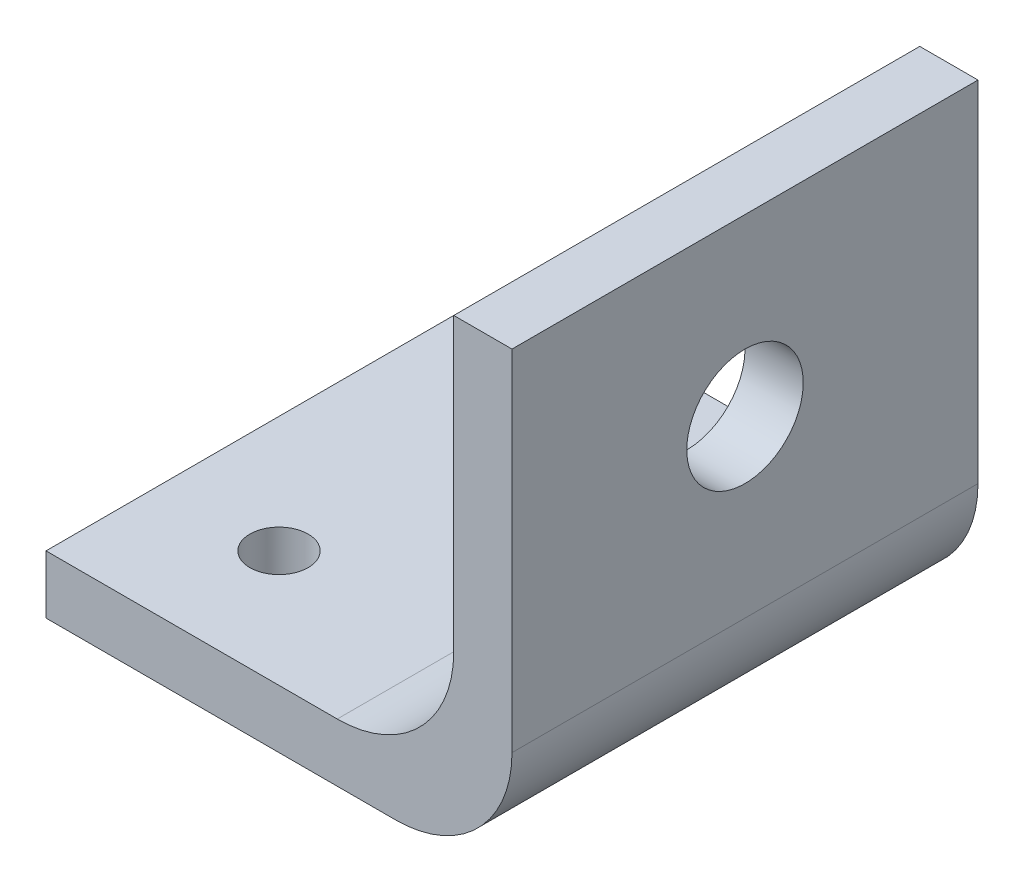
ISO-10303-21;
HEADER;
FILE_DESCRIPTION(('STEP AP214'),'2;1');
FILE_NAME('part.step','',(''),(''),'','','');
FILE_SCHEMA(('AUTOMOTIVE_DESIGN { 1 0 10303 214 1 1 1 1 }'));
ENDSEC;
DATA;
#1=APPLICATION_CONTEXT('core data for automotive mechanical design processes');
#2=APPLICATION_PROTOCOL_DEFINITION('international standard','automotive_design',2000,#1);
#3=PRODUCT_CONTEXT('',#1,'mechanical');
#4=PRODUCT('Part','Part','',(#3));
#5=PRODUCT_RELATED_PRODUCT_CATEGORY('part','',(#4));
#6=PRODUCT_DEFINITION_FORMATION('','',#4);
#7=PRODUCT_DEFINITION_CONTEXT('part definition',#1,'design');
#8=PRODUCT_DEFINITION('design','',#6,#7);
#9=PRODUCT_DEFINITION_SHAPE('','',#8);
#10=(LENGTH_UNIT() NAMED_UNIT(*) SI_UNIT(.MILLI.,.METRE.));
#11=(NAMED_UNIT(*) PLANE_ANGLE_UNIT() SI_UNIT($,.RADIAN.));
#12=(NAMED_UNIT(*) SI_UNIT($,.STERADIAN.) SOLID_ANGLE_UNIT());
#13=UNCERTAINTY_MEASURE_WITH_UNIT(LENGTH_MEASURE(1.E-05),#10,'distance_accuracy_value','');
#14=(GEOMETRIC_REPRESENTATION_CONTEXT(3) GLOBAL_UNCERTAINTY_ASSIGNED_CONTEXT((#13)) GLOBAL_UNIT_ASSIGNED_CONTEXT((#10,
#11,#12)) REPRESENTATION_CONTEXT('',''));
#15=CARTESIAN_POINT('',(0.,0.,0.));
#16=DIRECTION('',(0.,0.,1.));
#17=DIRECTION('',(1.,0.,0.));
#18=AXIS2_PLACEMENT_3D('',#15,#16,#17);
#19=CARTESIAN_POINT('',(0.,0.,40.));
#20=DIRECTION('',(-1.,0.,0.));
#21=DIRECTION('',(0.,0.,1.));
#22=AXIS2_PLACEMENT_3D('',#19,#20,#21);
#23=PLANE('',#22);
#24=DIRECTION('',(0.,1.,0.));
#25=VECTOR('',#24,1.);
#26=CARTESIAN_POINT('',(0.,0.,0.));
#27=LINE('',#26,#25);
#28=CARTESIAN_POINT('',(0.,0.,0.));
#29=VERTEX_POINT('',#28);
#30=CARTESIAN_POINT('',(0.,5.,0.));
#31=VERTEX_POINT('',#30);
#32=EDGE_CURVE('E134',#29,#31,#27,.T.);
#33=ORIENTED_EDGE('',*,*,#32,.F.);
#34=DIRECTION('',(0.,0.,-1.));
#35=VECTOR('',#34,1.);
#36=CARTESIAN_POINT('',(0.,0.,40.));
#37=LINE('',#36,#35);
#38=CARTESIAN_POINT('',(0.,0.,40.));
#39=VERTEX_POINT('',#38);
#40=EDGE_CURVE('E11',#39,#29,#37,.T.);
#41=ORIENTED_EDGE('',*,*,#40,.F.);
#42=DIRECTION('',(0.,1.,0.));
#43=VECTOR('',#42,1.);
#44=CARTESIAN_POINT('',(0.,0.,40.));
#45=LINE('',#44,#43);
#46=CARTESIAN_POINT('',(0.,5.,40.));
#47=VERTEX_POINT('',#46);
#48=EDGE_CURVE('E154',#39,#47,#45,.T.);
#49=ORIENTED_EDGE('',*,*,#48,.T.);
#50=DIRECTION('',(0.,0.,-1.));
#51=VECTOR('',#50,1.);
#52=CARTESIAN_POINT('',(0.,5.,40.));
#53=LINE('',#52,#51);
#54=EDGE_CURVE('E94',#47,#31,#53,.T.);
#55=ORIENTED_EDGE('',*,*,#54,.T.);
#56=EDGE_LOOP('',(#33,#41,#49,#55));
#57=FACE_BOUND('',#56,.T.);
#58=ADVANCED_FACE('F38',(#57),#23,.T.);
#59=CARTESIAN_POINT('',(0.,0.,40.));
#60=DIRECTION('',(0.,1.,0.));
#61=DIRECTION('',(0.,0.,1.));
#62=AXIS2_PLACEMENT_3D('',#59,#60,#61);
#63=PLANE('',#62);
#64=CARTESIAN_POINT('',(10.,0.,10.));
#65=DIRECTION('',(0.,-1.,0.));
#66=DIRECTION('',(0.,0.,-1.));
#67=AXIS2_PLACEMENT_3D('',#64,#65,#66);
#68=CIRCLE('',#67,2.5);
#69=CARTESIAN_POINT('',(10.,0.,7.5));
#70=VERTEX_POINT('',#69);
#71=EDGE_CURVE('E169',#70,#70,#68,.T.);
#72=ORIENTED_EDGE('',*,*,#71,.F.);
#73=EDGE_LOOP('',(#72));
#74=FACE_BOUND('',#73,.T.);
#75=CARTESIAN_POINT('',(10.,0.,30.));
#76=DIRECTION('',(0.,-1.,0.));
#77=DIRECTION('',(0.,0.,-1.));
#78=AXIS2_PLACEMENT_3D('',#75,#76,#77);
#79=CIRCLE('',#78,2.5);
#80=CARTESIAN_POINT('',(10.,0.,27.5));
#81=VERTEX_POINT('',#80);
#82=EDGE_CURVE('E166',#81,#81,#79,.T.);
#83=ORIENTED_EDGE('',*,*,#82,.F.);
#84=EDGE_LOOP('',(#83));
#85=FACE_BOUND('',#84,.T.);
#86=DIRECTION('',(1.,0.,0.));
#87=VECTOR('',#86,1.);
#88=CARTESIAN_POINT('',(0.,0.,0.));
#89=LINE('',#88,#87);
#90=CARTESIAN_POINT('',(30.,0.,0.));
#91=VERTEX_POINT('',#90);
#92=EDGE_CURVE('E153',#29,#91,#89,.T.);
#93=ORIENTED_EDGE('',*,*,#92,.T.);
#94=DIRECTION('',(0.,0.,-1.));
#95=VECTOR('',#94,1.);
#96=CARTESIAN_POINT('',(30.,0.,40.));
#97=LINE('',#96,#95);
#98=CARTESIAN_POINT('',(30.,0.,40.));
#99=VERTEX_POINT('',#98);
#100=EDGE_CURVE('E47',#99,#91,#97,.T.);
#101=ORIENTED_EDGE('',*,*,#100,.F.);
#102=DIRECTION('',(1.,0.,0.));
#103=VECTOR('',#102,1.);
#104=CARTESIAN_POINT('',(0.,0.,40.));
#105=LINE('',#104,#103);
#106=EDGE_CURVE('E129',#39,#99,#105,.T.);
#107=ORIENTED_EDGE('',*,*,#106,.F.);
#108=ORIENTED_EDGE('',*,*,#40,.T.);
#109=EDGE_LOOP('',(#93,#101,#107,#108));
#110=FACE_BOUND('',#109,.T.);
#111=ADVANCED_FACE('F206',(#74,#85,#110),#63,.F.);
#112=CARTESIAN_POINT('',(30.,10.,40.));
#113=DIRECTION('',(0.,0.,-1.));
#114=DIRECTION('',(-1.,0.,0.));
#115=AXIS2_PLACEMENT_3D('',#112,#113,#114);
#116=CYLINDRICAL_SURFACE('',#115,10.);
#117=CARTESIAN_POINT('',(30.,10.,0.));
#118=DIRECTION('',(0.,0.,-1.));
#119=DIRECTION('',(-1.,0.,0.));
#120=AXIS2_PLACEMENT_3D('',#117,#118,#119);
#121=CIRCLE('',#120,10.);
#122=CARTESIAN_POINT('',(40.,10.0000000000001,0.));
#123=VERTEX_POINT('',#122);
#124=EDGE_CURVE('E114',#123,#91,#121,.T.);
#125=ORIENTED_EDGE('',*,*,#124,.F.);
#126=DIRECTION('',(0.,0.,-1.));
#127=VECTOR('',#126,1.);
#128=CARTESIAN_POINT('',(40.,10.0000000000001,40.));
#129=LINE('',#128,#127);
#130=CARTESIAN_POINT('',(40.,10.0000000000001,40.));
#131=VERTEX_POINT('',#130);
#132=EDGE_CURVE('E108',#131,#123,#129,.T.);
#133=ORIENTED_EDGE('',*,*,#132,.F.);
#134=CARTESIAN_POINT('',(30.,10.,40.));
#135=DIRECTION('',(0.,0.,-1.));
#136=DIRECTION('',(-1.,0.,0.));
#137=AXIS2_PLACEMENT_3D('',#134,#135,#136);
#138=CIRCLE('',#137,10.);
#139=EDGE_CURVE('E112',#131,#99,#138,.T.);
#140=ORIENTED_EDGE('',*,*,#139,.T.);
#141=ORIENTED_EDGE('',*,*,#100,.T.);
#142=EDGE_LOOP('',(#125,#133,#140,#141));
#143=FACE_BOUND('',#142,.T.);
#144=ADVANCED_FACE('F110',(#143),#116,.T.);
#145=CARTESIAN_POINT('',(40.,10.0000000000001,40.));
#146=DIRECTION('',(-1.,0.,0.));
#147=DIRECTION('',(0.,-1.,0.));
#148=AXIS2_PLACEMENT_3D('',#145,#146,#147);
#149=PLANE('',#148);
#150=CARTESIAN_POINT('',(40.,25.,20.));
#151=DIRECTION('',(1.,0.,0.));
#152=DIRECTION('',(0.,1.,0.));
#153=AXIS2_PLACEMENT_3D('',#150,#151,#152);
#154=CIRCLE('',#153,5.);
#155=CARTESIAN_POINT('',(40.,30.,20.));
#156=VERTEX_POINT('',#155);
#157=EDGE_CURVE('E179',#156,#156,#154,.T.);
#158=ORIENTED_EDGE('',*,*,#157,.F.);
#159=EDGE_LOOP('',(#158));
#160=FACE_BOUND('',#159,.T.);
#161=DIRECTION('',(0.,1.,0.));
#162=VECTOR('',#161,1.);
#163=CARTESIAN_POINT('',(40.,10.0000000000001,0.));
#164=LINE('',#163,#162);
#165=CARTESIAN_POINT('',(40.,40.,0.));
#166=VERTEX_POINT('',#165);
#167=EDGE_CURVE('E150',#123,#166,#164,.T.);
#168=ORIENTED_EDGE('',*,*,#167,.T.);
#169=DIRECTION('',(0.,0.,-1.));
#170=VECTOR('',#169,1.);
#171=CARTESIAN_POINT('',(40.,40.,40.));
#172=LINE('',#171,#170);
#173=CARTESIAN_POINT('',(40.,40.,40.));
#174=VERTEX_POINT('',#173);
#175=EDGE_CURVE('E117',#174,#166,#172,.T.);
#176=ORIENTED_EDGE('',*,*,#175,.F.);
#177=DIRECTION('',(0.,1.,0.));
#178=VECTOR('',#177,1.);
#179=CARTESIAN_POINT('',(40.,10.0000000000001,40.));
#180=LINE('',#179,#178);
#181=EDGE_CURVE('E120',#131,#174,#180,.T.);
#182=ORIENTED_EDGE('',*,*,#181,.F.);
#183=ORIENTED_EDGE('',*,*,#132,.T.);
#184=EDGE_LOOP('',(#168,#176,#182,#183));
#185=FACE_BOUND('',#184,.T.);
#186=ADVANCED_FACE('F121',(#160,#185),#149,.F.);
#187=CARTESIAN_POINT('',(40.,40.,40.));
#188=DIRECTION('',(0.,-1.,0.));
#189=DIRECTION('',(1.,0.,0.));
#190=AXIS2_PLACEMENT_3D('',#187,#188,#189);
#191=PLANE('',#190);
#192=DIRECTION('',(-1.,0.,0.));
#193=VECTOR('',#192,1.);
#194=CARTESIAN_POINT('',(40.,40.,0.));
#195=LINE('',#194,#193);
#196=CARTESIAN_POINT('',(35.,40.,0.));
#197=VERTEX_POINT('',#196);
#198=EDGE_CURVE('E147',#166,#197,#195,.T.);
#199=ORIENTED_EDGE('',*,*,#198,.T.);
#200=DIRECTION('',(0.,0.,-1.));
#201=VECTOR('',#200,1.);
#202=CARTESIAN_POINT('',(35.,40.,40.));
#203=LINE('',#202,#201);
#204=CARTESIAN_POINT('',(35.,40.,40.));
#205=VERTEX_POINT('',#204);
#206=EDGE_CURVE('E158',#205,#197,#203,.T.);
#207=ORIENTED_EDGE('',*,*,#206,.F.);
#208=DIRECTION('',(-1.,0.,0.));
#209=VECTOR('',#208,1.);
#210=CARTESIAN_POINT('',(40.,40.,40.));
#211=LINE('',#210,#209);
#212=EDGE_CURVE('E125',#174,#205,#211,.T.);
#213=ORIENTED_EDGE('',*,*,#212,.F.);
#214=ORIENTED_EDGE('',*,*,#175,.T.);
#215=EDGE_LOOP('',(#199,#207,#213,#214));
#216=FACE_BOUND('',#215,.T.);
#217=ADVANCED_FACE('F194',(#216),#191,.F.);
#218=CARTESIAN_POINT('',(35.,15.0000000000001,40.));
#219=DIRECTION('',(-1.,0.,0.));
#220=DIRECTION('',(0.,0.,1.));
#221=AXIS2_PLACEMENT_3D('',#218,#219,#220);
#222=PLANE('',#221);
#223=CARTESIAN_POINT('',(35.,25.,20.));
#224=DIRECTION('',(-1.,0.,0.));
#225=DIRECTION('',(0.,0.,1.));
#226=AXIS2_PLACEMENT_3D('',#223,#224,#225);
#227=CIRCLE('',#226,5.);
#228=CARTESIAN_POINT('',(35.,25.,25.));
#229=VERTEX_POINT('',#228);
#230=EDGE_CURVE('E41',#229,#229,#227,.T.);
#231=ORIENTED_EDGE('',*,*,#230,.F.);
#232=EDGE_LOOP('',(#231));
#233=FACE_BOUND('',#232,.T.);
#234=DIRECTION('',(0.,1.,0.));
#235=VECTOR('',#234,1.);
#236=CARTESIAN_POINT('',(35.,15.0000000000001,0.));
#237=LINE('',#236,#235);
#238=CARTESIAN_POINT('',(35.,15.,0.));
#239=VERTEX_POINT('',#238);
#240=EDGE_CURVE('E144',#239,#197,#237,.T.);
#241=ORIENTED_EDGE('',*,*,#240,.F.);
#242=DIRECTION('',(0.,0.,-1.));
#243=VECTOR('',#242,1.);
#244=CARTESIAN_POINT('',(35.,15.,40.));
#245=LINE('',#244,#243);
#246=CARTESIAN_POINT('',(35.,15.,40.));
#247=VERTEX_POINT('',#246);
#248=EDGE_CURVE('E160',#247,#239,#245,.T.);
#249=ORIENTED_EDGE('',*,*,#248,.F.);
#250=DIRECTION('',(0.,1.,0.));
#251=VECTOR('',#250,1.);
#252=CARTESIAN_POINT('',(35.,15.0000000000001,40.));
#253=LINE('',#252,#251);
#254=EDGE_CURVE('E188',#247,#205,#253,.T.);
#255=ORIENTED_EDGE('',*,*,#254,.T.);
#256=ORIENTED_EDGE('',*,*,#206,.T.);
#257=EDGE_LOOP('',(#241,#249,#255,#256));
#258=FACE_BOUND('',#257,.T.);
#259=ADVANCED_FACE('F198',(#233,#258),#222,.T.);
#260=CARTESIAN_POINT('',(25.,15.,40.));
#261=DIRECTION('',(0.,0.,-1.));
#262=DIRECTION('',(-1.,0.,0.));
#263=AXIS2_PLACEMENT_3D('',#260,#261,#262);
#264=CYLINDRICAL_SURFACE('',#263,10.);
#265=CARTESIAN_POINT('',(25.,15.,0.));
#266=DIRECTION('',(0.,0.,1.));
#267=DIRECTION('',(1.,0.,0.));
#268=AXIS2_PLACEMENT_3D('',#265,#266,#267);
#269=CIRCLE('',#268,10.);
#270=CARTESIAN_POINT('',(24.9999999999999,5.,0.));
#271=VERTEX_POINT('',#270);
#272=EDGE_CURVE('E141',#271,#239,#269,.T.);
#273=ORIENTED_EDGE('',*,*,#272,.F.);
#274=DIRECTION('',(0.,0.,-1.));
#275=VECTOR('',#274,1.);
#276=CARTESIAN_POINT('',(24.9999999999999,5.,40.));
#277=LINE('',#276,#275);
#278=CARTESIAN_POINT('',(24.9999999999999,5.,40.));
#279=VERTEX_POINT('',#278);
#280=EDGE_CURVE('E162',#279,#271,#277,.T.);
#281=ORIENTED_EDGE('',*,*,#280,.F.);
#282=CARTESIAN_POINT('',(25.,15.,40.));
#283=DIRECTION('',(0.,0.,1.));
#284=DIRECTION('',(1.,0.,0.));
#285=AXIS2_PLACEMENT_3D('',#282,#283,#284);
#286=CIRCLE('',#285,10.);
#287=EDGE_CURVE('E185',#279,#247,#286,.T.);
#288=ORIENTED_EDGE('',*,*,#287,.T.);
#289=ORIENTED_EDGE('',*,*,#248,.T.);
#290=EDGE_LOOP('',(#273,#281,#288,#289));
#291=FACE_BOUND('',#290,.T.);
#292=ADVANCED_FACE('F201',(#291),#264,.F.);
#293=CARTESIAN_POINT('',(0.,5.,40.));
#294=DIRECTION('',(0.,1.,0.));
#295=DIRECTION('',(0.,0.,1.));
#296=AXIS2_PLACEMENT_3D('',#293,#294,#295);
#297=PLANE('',#296);
#298=CARTESIAN_POINT('',(10.,5.,10.));
#299=DIRECTION('',(0.,1.,0.));
#300=DIRECTION('',(0.,0.,1.));
#301=AXIS2_PLACEMENT_3D('',#298,#299,#300);
#302=CIRCLE('',#301,2.5);
#303=CARTESIAN_POINT('',(10.,5.,12.5));
#304=VERTEX_POINT('',#303);
#305=EDGE_CURVE('E167',#304,#304,#302,.T.);
#306=ORIENTED_EDGE('',*,*,#305,.F.);
#307=EDGE_LOOP('',(#306));
#308=FACE_BOUND('',#307,.T.);
#309=CARTESIAN_POINT('',(10.,5.,30.));
#310=DIRECTION('',(0.,1.,0.));
#311=DIRECTION('',(0.,0.,1.));
#312=AXIS2_PLACEMENT_3D('',#309,#310,#311);
#313=CIRCLE('',#312,2.5);
#314=CARTESIAN_POINT('',(10.,5.,32.5));
#315=VERTEX_POINT('',#314);
#316=EDGE_CURVE('E138',#315,#315,#313,.T.);
#317=ORIENTED_EDGE('',*,*,#316,.F.);
#318=EDGE_LOOP('',(#317));
#319=FACE_BOUND('',#318,.T.);
#320=DIRECTION('',(1.,0.,0.));
#321=VECTOR('',#320,1.);
#322=CARTESIAN_POINT('',(0.,5.,0.));
#323=LINE('',#322,#321);
#324=EDGE_CURVE('E137',#31,#271,#323,.T.);
#325=ORIENTED_EDGE('',*,*,#324,.F.);
#326=ORIENTED_EDGE('',*,*,#54,.F.);
#327=DIRECTION('',(1.,0.,0.));
#328=VECTOR('',#327,1.);
#329=CARTESIAN_POINT('',(0.,5.,40.));
#330=LINE('',#329,#328);
#331=EDGE_CURVE('E183',#47,#279,#330,.T.);
#332=ORIENTED_EDGE('',*,*,#331,.T.);
#333=ORIENTED_EDGE('',*,*,#280,.T.);
#334=EDGE_LOOP('',(#325,#326,#332,#333));
#335=FACE_BOUND('',#334,.T.);
#336=ADVANCED_FACE('F202',(#308,#319,#335),#297,.T.);
#337=CARTESIAN_POINT('',(25.,15.,40.));
#338=DIRECTION('',(0.,0.,1.));
#339=DIRECTION('',(1.,0.,0.));
#340=AXIS2_PLACEMENT_3D('',#337,#338,#339);
#341=PLANE('',#340);
#342=ORIENTED_EDGE('',*,*,#48,.F.);
#343=ORIENTED_EDGE('',*,*,#106,.T.);
#344=ORIENTED_EDGE('',*,*,#139,.F.);
#345=ORIENTED_EDGE('',*,*,#181,.T.);
#346=ORIENTED_EDGE('',*,*,#212,.T.);
#347=ORIENTED_EDGE('',*,*,#254,.F.);
#348=ORIENTED_EDGE('',*,*,#287,.F.);
#349=ORIENTED_EDGE('',*,*,#331,.F.);
#350=EDGE_LOOP('',(#342,#343,#344,#345,#346,#347,#348,#349));
#351=FACE_BOUND('',#350,.T.);
#352=ADVANCED_FACE('F128',(#351),#341,.T.);
#353=CARTESIAN_POINT('',(25.,15.,0.));
#354=DIRECTION('',(0.,0.,1.));
#355=DIRECTION('',(1.,0.,0.));
#356=AXIS2_PLACEMENT_3D('',#353,#354,#355);
#357=PLANE('',#356);
#358=ORIENTED_EDGE('',*,*,#32,.T.);
#359=ORIENTED_EDGE('',*,*,#324,.T.);
#360=ORIENTED_EDGE('',*,*,#272,.T.);
#361=ORIENTED_EDGE('',*,*,#240,.T.);
#362=ORIENTED_EDGE('',*,*,#198,.F.);
#363=ORIENTED_EDGE('',*,*,#167,.F.);
#364=ORIENTED_EDGE('',*,*,#124,.T.);
#365=ORIENTED_EDGE('',*,*,#92,.F.);
#366=EDGE_LOOP('',(#358,#359,#360,#361,#362,#363,#364,#365));
#367=FACE_BOUND('',#366,.T.);
#368=ADVANCED_FACE('F204',(#367),#357,.F.);
#369=CARTESIAN_POINT('',(10.,40.,30.));
#370=DIRECTION('',(0.,-1.,0.));
#371=DIRECTION('',(0.,0.,-1.));
#372=AXIS2_PLACEMENT_3D('',#369,#370,#371);
#373=CYLINDRICAL_SURFACE('',#372,2.5);
#374=ORIENTED_EDGE('',*,*,#316,.T.);
#375=EDGE_LOOP('',(#374));
#376=FACE_BOUND('',#375,.T.);
#377=ORIENTED_EDGE('',*,*,#82,.T.);
#378=EDGE_LOOP('',(#377));
#379=FACE_BOUND('',#378,.T.);
#380=ADVANCED_FACE('F237',(#376,#379),#373,.F.);
#381=CARTESIAN_POINT('',(10.,40.,10.));
#382=DIRECTION('',(0.,-1.,0.));
#383=DIRECTION('',(0.,0.,-1.));
#384=AXIS2_PLACEMENT_3D('',#381,#382,#383);
#385=CYLINDRICAL_SURFACE('',#384,2.5);
#386=ORIENTED_EDGE('',*,*,#305,.T.);
#387=EDGE_LOOP('',(#386));
#388=FACE_BOUND('',#387,.T.);
#389=ORIENTED_EDGE('',*,*,#71,.T.);
#390=EDGE_LOOP('',(#389));
#391=FACE_BOUND('',#390,.T.);
#392=ADVANCED_FACE('F240',(#388,#391),#385,.F.);
#393=CARTESIAN_POINT('',(0.,25.,20.));
#394=DIRECTION('',(1.,0.,0.));
#395=DIRECTION('',(0.,1.,0.));
#396=AXIS2_PLACEMENT_3D('',#393,#394,#395);
#397=CYLINDRICAL_SURFACE('',#396,5.);
#398=ORIENTED_EDGE('',*,*,#230,.T.);
#399=EDGE_LOOP('',(#398));
#400=FACE_BOUND('',#399,.T.);
#401=ORIENTED_EDGE('',*,*,#157,.T.);
#402=EDGE_LOOP('',(#401));
#403=FACE_BOUND('',#402,.T.);
#404=ADVANCED_FACE('F247',(#400,#403),#397,.F.);
#405=CLOSED_SHELL('',(#58,#111,#144,#186,#217,#259,#292,#336,#352,#368,#380,#392,#404));
#406=MANIFOLD_SOLID_BREP('B2',#405);
#407=ADVANCED_BREP_SHAPE_REPRESENTATION('',(#18,#406),#14);
#408=SHAPE_DEFINITION_REPRESENTATION(#9,#407);
ENDSEC;
END-ISO-10303-21;
